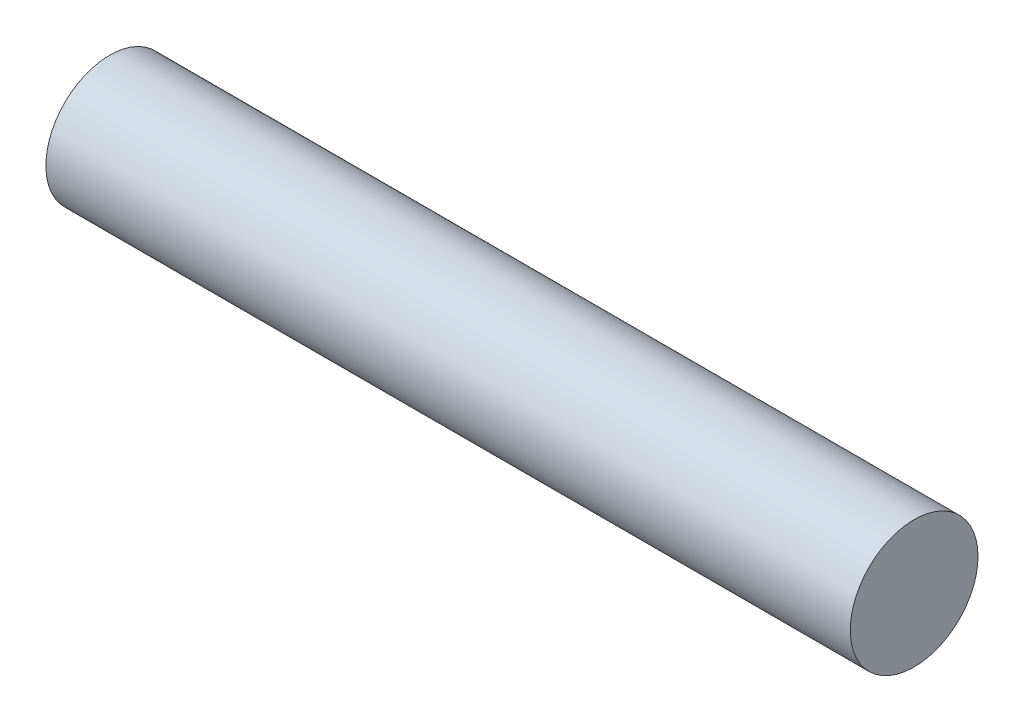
ISO-10303-21;
HEADER;
FILE_DESCRIPTION(('STEP AP214'),'2;1');
FILE_NAME('part.step','',(''),(''),'','','');
FILE_SCHEMA(('AUTOMOTIVE_DESIGN { 1 0 10303 214 1 1 1 1 }'));
ENDSEC;
DATA;
#1=APPLICATION_CONTEXT('core data for automotive mechanical design processes');
#2=APPLICATION_PROTOCOL_DEFINITION('international standard','automotive_design',2000,#1);
#3=PRODUCT_CONTEXT('',#1,'mechanical');
#4=PRODUCT('Part','Part','',(#3));
#5=PRODUCT_RELATED_PRODUCT_CATEGORY('part','',(#4));
#6=PRODUCT_DEFINITION_FORMATION('','',#4);
#7=PRODUCT_DEFINITION_CONTEXT('part definition',#1,'design');
#8=PRODUCT_DEFINITION('design','',#6,#7);
#9=PRODUCT_DEFINITION_SHAPE('','',#8);
#10=(LENGTH_UNIT() NAMED_UNIT(*) SI_UNIT(.MILLI.,.METRE.));
#11=(NAMED_UNIT(*) PLANE_ANGLE_UNIT() SI_UNIT($,.RADIAN.));
#12=(NAMED_UNIT(*) SI_UNIT($,.STERADIAN.) SOLID_ANGLE_UNIT());
#13=UNCERTAINTY_MEASURE_WITH_UNIT(LENGTH_MEASURE(1.E-05),#10,'distance_accuracy_value','');
#14=(GEOMETRIC_REPRESENTATION_CONTEXT(3) GLOBAL_UNCERTAINTY_ASSIGNED_CONTEXT((#13)) GLOBAL_UNIT_ASSIGNED_CONTEXT((#10,
#11,#12)) REPRESENTATION_CONTEXT('',''));
#15=CARTESIAN_POINT('',(0.,0.,0.));
#16=DIRECTION('',(0.,0.,1.));
#17=DIRECTION('',(1.,0.,0.));
#18=AXIS2_PLACEMENT_3D('',#15,#16,#17);
#19=CARTESIAN_POINT('',(60.,0.,0.));
#20=DIRECTION('',(-1.,0.,0.));
#21=DIRECTION('',(0.,0.,1.));
#22=AXIS2_PLACEMENT_3D('',#19,#20,#21);
#23=CYLINDRICAL_SURFACE('',#22,4.7625);
#24=CARTESIAN_POINT('',(60.,0.,0.));
#25=DIRECTION('',(1.,0.,0.));
#26=DIRECTION('',(0.,0.,-1.));
#27=AXIS2_PLACEMENT_3D('',#24,#25,#26);
#28=CIRCLE('',#27,4.7625);
#29=CARTESIAN_POINT('',(60.,0.,-4.7625));
#30=VERTEX_POINT('',#29);
#31=EDGE_CURVE('E10',#30,#30,#28,.T.);
#32=ORIENTED_EDGE('',*,*,#31,.F.);
#33=EDGE_LOOP('',(#32));
#34=FACE_BOUND('',#33,.T.);
#35=CARTESIAN_POINT('',(0.,0.,0.));
#36=DIRECTION('',(1.,0.,0.));
#37=DIRECTION('',(0.,0.,-1.));
#38=AXIS2_PLACEMENT_3D('',#35,#36,#37);
#39=CIRCLE('',#38,4.7625);
#40=CARTESIAN_POINT('',(0.,0.,-4.7625));
#41=VERTEX_POINT('',#40);
#42=EDGE_CURVE('E33',#41,#41,#39,.T.);
#43=ORIENTED_EDGE('',*,*,#42,.T.);
#44=EDGE_LOOP('',(#43));
#45=FACE_BOUND('',#44,.T.);
#46=ADVANCED_FACE('F30',(#34,#45),#23,.T.);
#47=CARTESIAN_POINT('',(60.,0.,0.));
#48=DIRECTION('',(1.,0.,0.));
#49=DIRECTION('',(0.,0.,-1.));
#50=AXIS2_PLACEMENT_3D('',#47,#48,#49);
#51=PLANE('',#50);
#52=ORIENTED_EDGE('',*,*,#31,.T.);
#53=EDGE_LOOP('',(#52));
#54=FACE_BOUND('',#53,.T.);
#55=ADVANCED_FACE('F45',(#54),#51,.T.);
#56=CARTESIAN_POINT('',(0.,0.,0.));
#57=DIRECTION('',(1.,0.,0.));
#58=DIRECTION('',(0.,0.,-1.));
#59=AXIS2_PLACEMENT_3D('',#56,#57,#58);
#60=PLANE('',#59);
#61=ORIENTED_EDGE('',*,*,#42,.F.);
#62=EDGE_LOOP('',(#61));
#63=FACE_BOUND('',#62,.T.);
#64=ADVANCED_FACE('F43',(#63),#60,.F.);
#65=CLOSED_SHELL('',(#46,#55,#64));
#66=MANIFOLD_SOLID_BREP('B2',#65);
#67=ADVANCED_BREP_SHAPE_REPRESENTATION('',(#18,#66),#14);
#68=SHAPE_DEFINITION_REPRESENTATION(#9,#67);
ENDSEC;
END-ISO-10303-21;
